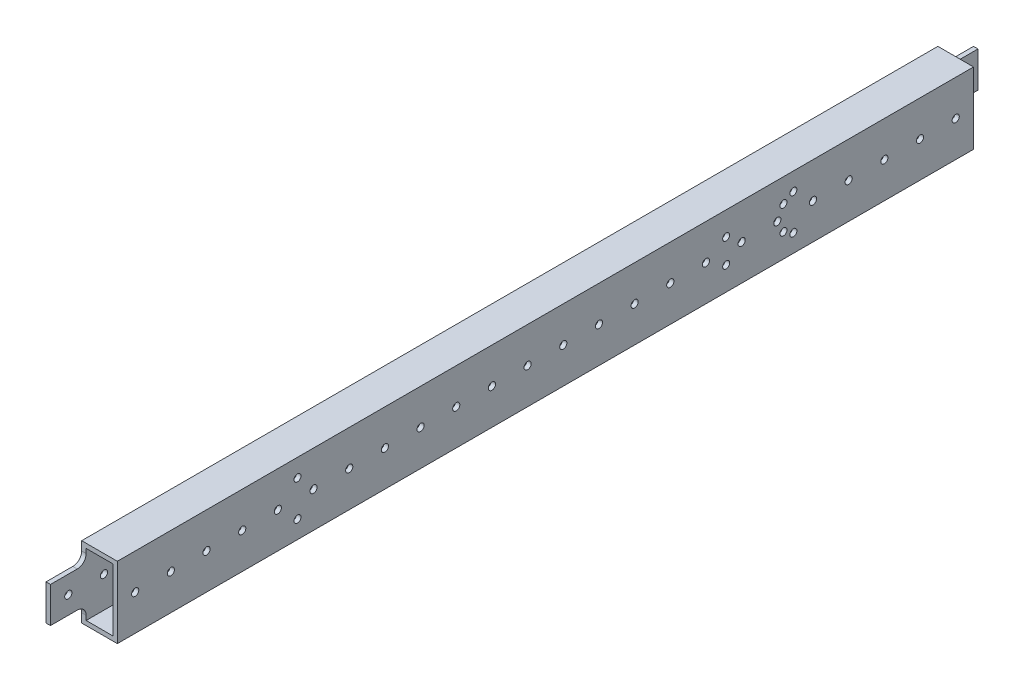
from build123d import *

# Parameters (mm, degrees)
SKETCH1_W           = 25.4
SKETCH1_H           = 50.8
SKETCH1_W_2         = 19.05
SKETCH1_H_2         = 44.45
BOSS_EXTRUDE1_DEPTH = 660.4
SKETCH2_W           = 22.225
SKETCH2_H           = 25.4
CUT_EXTRUDE1_DEPTH  = 663.837808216
SKETCH3_R           = 2.5527
CUT_EXTRUDE2_DEPTH  = 663.837808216
LPATTERN1_COUNT     = 25
LPATTERN1_PITCH     = 25.4
CUT_EXTRUDE3_DEPTH  = 663.723736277
SKETCH6_R           = 2.4892
CUT_EXTRUDE4_DEPTH  = 663.837808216
SKETCH8_R           = 2.0193
CUT_EXTRUDE5_DEPTH  = 25.4
SKETCH9_R           = 2.4892
CUT_EXTRUDE6_DEPTH  = 3.175


with BuildPart() as part:
    # Sketch1 → Boss-Extrude1 (new body)
    with BuildSketch(Plane.XY):
        with Locations((12.7, 25.4)):
            Rectangle(SKETCH1_W, SKETCH1_H)
        with Locations((12.7, 25.4)):
            Rectangle(SKETCH1_W_2, SKETCH1_H_2, mode=Mode.SUBTRACT)
    extrude(amount=BOSS_EXTRUDE1_DEPTH)

    # Sketch2 → Cut-Extrude1 (cut, through all)
    with BuildSketch(Plane(origin=(0, 50.8, 0), x_dir=(1, 0, 0), z_dir=(0, 1, 0))):
        with Locations((14.2875, -12.7)):
            Rectangle(SKETCH2_W, SKETCH2_H)
        with Locations((14.2875, -647.7)):
            Rectangle(SKETCH2_W, SKETCH2_H)
    extrude(amount=-CUT_EXTRUDE1_DEPTH, mode=Mode.SUBTRACT)

    # Sketch3 → Cut-Extrude2 (cut, through all)
    with BuildSketch(Plane.ZY):
        with Locations((647.7, 25.4)):
            Circle(SKETCH3_R)
        with Locations((12.7, 25.4)):
            Circle(SKETCH3_R)
    cut_extrude2 = extrude(amount=-CUT_EXTRUDE2_DEPTH, mode=Mode.SUBTRACT)

    # LPattern1: Cut-Extrude2 ×25
    with Locations(*[(0, 0, -i * LPATTERN1_PITCH) for i in range(1, LPATTERN1_COUNT)]):
        add(cut_extrude2, mode=Mode.SUBTRACT)

    # Sketch4 → Cut-Extrude3 (cut, through all)
    with BuildSketch(Plane(origin=(3.175, 0, 0), x_dir=(0, 0, -1), z_dir=(1, 0, 0))):
        with BuildLine():
            Line((0, 50.8), (-25.4, 50.8))
            Line((-25.4, 50.8), (-25.4, 44.45))
            ThreePointArc((-25.4, 44.45), (-23.540128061, 39.959871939), (-19.05, 38.1))
            Line((-19.05, 38.1), (0, 38.1))
            Line((0, 38.1), (0, 50.8))
        make_face()
        with BuildLine():
            Line((-25.4, 0), (-25.4, 6.35))
            ThreePointArc((-25.4, 6.35), (-23.540128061, 10.840128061), (-19.05, 12.7))
            Line((-19.05, 12.7), (0, 12.7))
            Line((0, 12.7), (0, 0))
            Line((0, 0), (-25.4, 0))
        make_face()
        with BuildLine():
            Line((-660.4, 0), (-635, 0))
            Line((-635, 0), (-635, 6.35))
            ThreePointArc((-635, 6.35), (-636.859871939, 10.840128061), (-641.35, 12.7))
            Line((-641.35, 12.7), (-660.4, 12.7))
            Line((-660.4, 12.7), (-660.4, 0))
        make_face()
        with BuildLine():
            Line((-635, 50.8), (-635, 44.45))
            ThreePointArc((-635, 44.45), (-636.859871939, 39.959871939), (-641.35, 38.1))
            Line((-641.35, 38.1), (-660.4, 38.1))
            Line((-660.4, 38.1), (-660.4, 50.8))
            Line((-660.4, 50.8), (-635, 50.8))
        make_face()
    extrude(amount=-CUT_EXTRUDE3_DEPTH, mode=Mode.SUBTRACT)

    # Sketch6 → Cut-Extrude4 (cut, through all)
    with BuildSketch(Plane.ZY):
        with Locations((506.7375, 12.7)):
            Circle(SKETCH6_R)
        with Locations((506.7375, 38.1)):
            Circle(SKETCH6_R)
        with Locations((153.6625, 38.1)):
            Circle(SKETCH6_R)
        with Locations((153.6625, 12.7)):
            Circle(SKETCH6_R)
    extrude(amount=-CUT_EXTRUDE4_DEPTH, mode=Mode.SUBTRACT)

    # Sketch8 → Cut-Extrude5 (cut)
    with BuildSketch(Plane.ZY):
        with Locations((160.7237, 16.7894)):
            Circle(SKETCH8_R)
        with Locations((160.7237, 34.0106)):
            Circle(SKETCH8_R)
        with Locations((201.5161, 34.0106)):
            Circle(SKETCH8_R)
        with Locations((201.5161, 16.7894)):
            Circle(SKETCH8_R)
    extrude(amount=-CUT_EXTRUDE5_DEPTH, mode=Mode.SUBTRACT)

    # Sketch9 → Cut-Extrude6 (cut)
    with BuildSketch(Plane(origin=(25.4, 0, 0), x_dir=(0, 0, -1), z_dir=(1, 0, 0))):
        with Locations((-201.5161, 34.0106)):
            Circle(SKETCH9_R)
        with Locations((-160.7237, 34.0106)):
            Circle(SKETCH9_R)
        with Locations((-160.7237, 16.7894)):
            Circle(SKETCH9_R)
        with Locations((-201.5161, 16.7894)):
            Circle(SKETCH9_R)
    extrude(amount=-CUT_EXTRUDE6_DEPTH, mode=Mode.SUBTRACT)


solid = part.part
